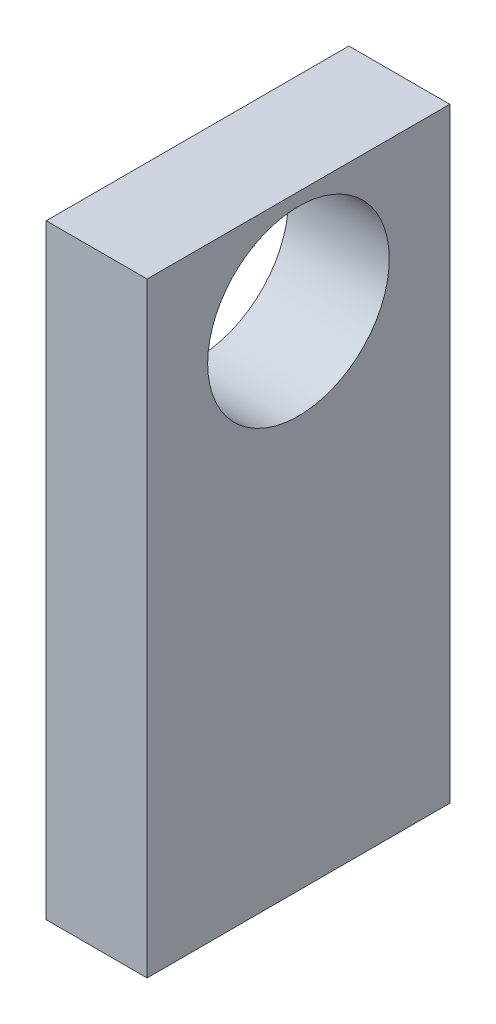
from build123d import *

# Parameters (mm, degrees)
SKETCH1_W           = 6.35
SKETCH1_H           = 19.05
BOSS_EXTRUDE1_DEPTH = 38.1
CUT_EXTRUDE1_REACH  = 41.783
SKETCH2_R           = 5.715


with BuildPart() as part:
    # Sketch1 → Boss-Extrude1 (new body)
    with BuildSketch(Plane(origin=(0, 0, 0), x_dir=(1, 0, 0), z_dir=(0, 1, 0))):
        Rectangle(SKETCH1_W, SKETCH1_H)
    extrude(amount=BOSS_EXTRUDE1_DEPTH)

    # Sketch2 → Cut-Extrude1 (cut, up to next)
    with BuildSketch(Plane(origin=(3.175, 0, 0), x_dir=(0, 0, -1), z_dir=(1, 0, 0)), mode=Mode.PRIVATE) as cut_extrude1_sk1:
        with Locations((0, 31.581272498)):
            Circle(SKETCH2_R)
    cut_extrude1_tool1 = extrude(cut_extrude1_sk1.sketch, amount=-CUT_EXTRUDE1_REACH, mode=Mode.PRIVATE) & part.part
    add(cut_extrude1_tool1.solids().sort_by_distance((3.175, 31.581272, 0))[0], mode=Mode.SUBTRACT)


solid = part.part
